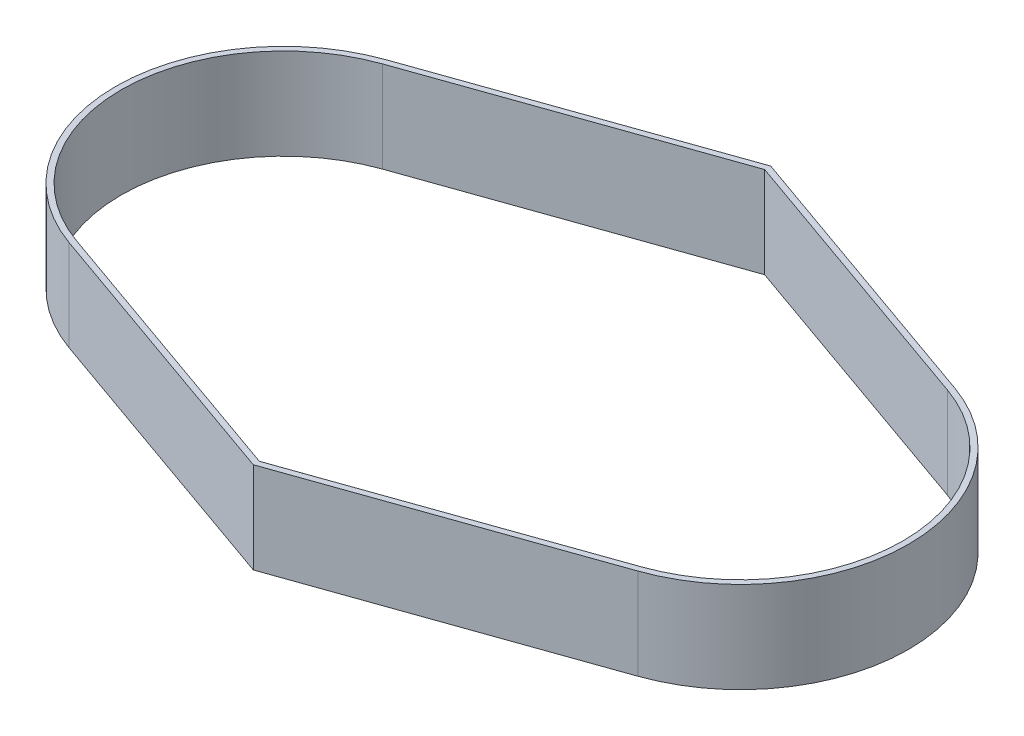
from build123d import *

# Parameters (mm, degrees)
BOSS_EXTRUDE1_DEPTH = 50.8


with BuildPart() as part:
    # Sketch1 → Boss-Extrude1 (new body)
    with BuildSketch(Plane(origin=(0, 0, 0), x_dir=(1, 0, 0), z_dir=(0, 1, 0))):
        with BuildLine():
            Line((-158.505524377, 88.335033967), (0, 144.208359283))
            Line((0, 144.208359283), (158.505524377, 88.335033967))
            ThreePointArc((158.505524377, 88.335033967), (221.029853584, 0), (158.505524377, -88.335033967))
            Line((158.505524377, -88.335033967), (0, -144.208359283))
            Line((0, -144.208359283), (-158.505524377, -88.335033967))
            ThreePointArc((-158.505524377, -88.335033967), (-221.029853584, 0), (-158.505524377, 88.335033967))
        make_face()
        with BuildLine():
            Line((-157.449993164, 85.340626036), (0, 140.841875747))
            Line((0, 140.841875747), (157.449993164, 85.340626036))
            ThreePointArc((157.449993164, 85.340626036), (217.854853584, 0), (157.449993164, -85.340626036))
            Line((157.449993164, -85.340626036), (0, -140.841875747))
            Line((0, -140.841875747), (-157.449993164, -85.340626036))
            ThreePointArc((-157.449993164, -85.340626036), (-217.854853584, 0), (-157.449993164, 85.340626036))
        make_face(mode=Mode.SUBTRACT)
    extrude(amount=BOSS_EXTRUDE1_DEPTH)


solid = part.part
